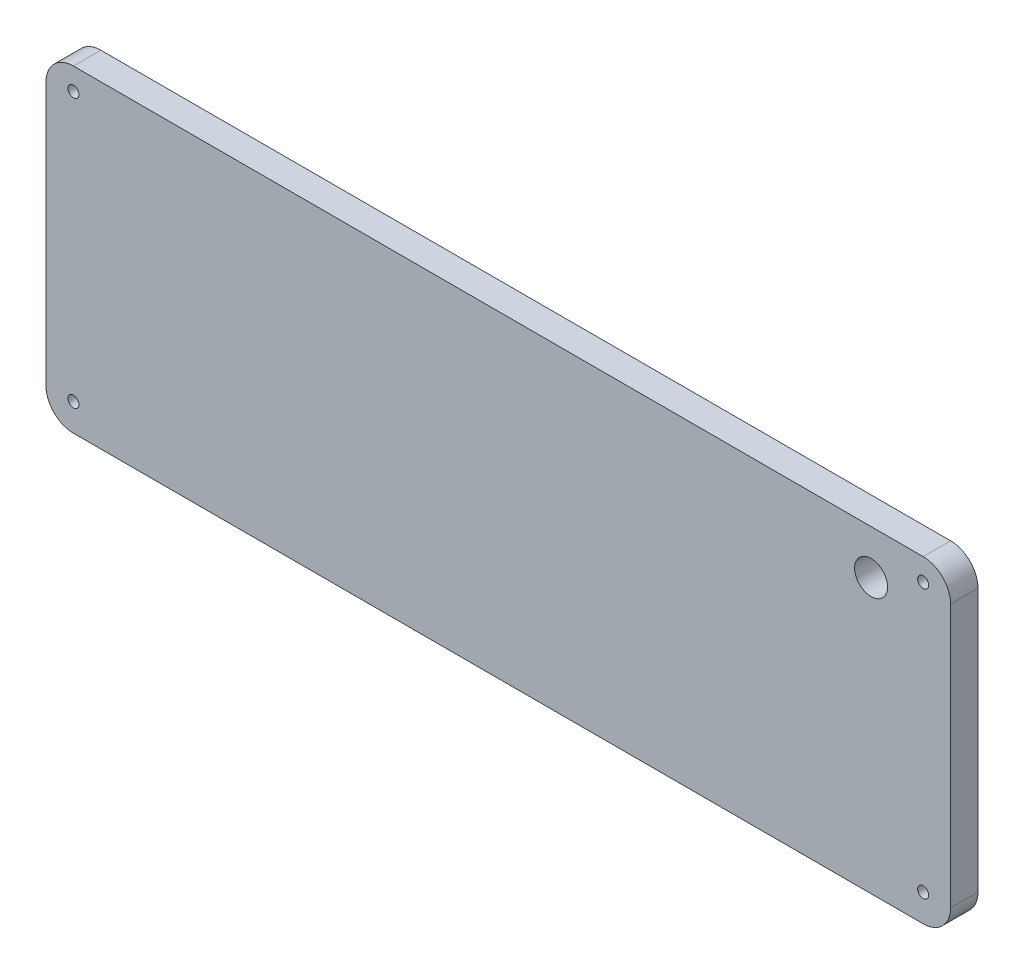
ISO-10303-21;
HEADER;
FILE_DESCRIPTION(('STEP AP214'),'2;1');
FILE_NAME('part.step','',(''),(''),'','','');
FILE_SCHEMA(('AUTOMOTIVE_DESIGN { 1 0 10303 214 1 1 1 1 }'));
ENDSEC;
DATA;
#1=APPLICATION_CONTEXT('core data for automotive mechanical design processes');
#2=APPLICATION_PROTOCOL_DEFINITION('international standard','automotive_design',2000,#1);
#3=PRODUCT_CONTEXT('',#1,'mechanical');
#4=PRODUCT('Part','Part','',(#3));
#5=PRODUCT_RELATED_PRODUCT_CATEGORY('part','',(#4));
#6=PRODUCT_DEFINITION_FORMATION('','',#4);
#7=PRODUCT_DEFINITION_CONTEXT('part definition',#1,'design');
#8=PRODUCT_DEFINITION('design','',#6,#7);
#9=PRODUCT_DEFINITION_SHAPE('','',#8);
#10=(LENGTH_UNIT() NAMED_UNIT(*) SI_UNIT(.MILLI.,.METRE.));
#11=(NAMED_UNIT(*) PLANE_ANGLE_UNIT() SI_UNIT($,.RADIAN.));
#12=(NAMED_UNIT(*) SI_UNIT($,.STERADIAN.) SOLID_ANGLE_UNIT());
#13=UNCERTAINTY_MEASURE_WITH_UNIT(LENGTH_MEASURE(1.E-05),#10,'distance_accuracy_value','');
#14=(GEOMETRIC_REPRESENTATION_CONTEXT(3) GLOBAL_UNCERTAINTY_ASSIGNED_CONTEXT((#13)) GLOBAL_UNIT_ASSIGNED_CONTEXT((#10,
#11,#12)) REPRESENTATION_CONTEXT('',''));
#15=CARTESIAN_POINT('',(0.,0.,0.));
#16=DIRECTION('',(0.,0.,1.));
#17=DIRECTION('',(1.,0.,0.));
#18=AXIS2_PLACEMENT_3D('',#15,#16,#17);
#19=CARTESIAN_POINT('',(90.5919495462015,-62.8912339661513,52.5871462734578));
#20=DIRECTION('',(-1.,0.,0.));
#21=DIRECTION('',(0.,0.,1.));
#22=AXIS2_PLACEMENT_3D('',#19,#20,#21);
#23=PLANE('',#22);
#24=DIRECTION('',(0.,1.,0.));
#25=VECTOR('',#24,1.);
#26=CARTESIAN_POINT('',(90.5919495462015,-62.8912339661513,42.5871462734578));
#27=LINE('',#26,#25);
#28=CARTESIAN_POINT('',(90.5919495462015,-52.8912339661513,42.5871462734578));
#29=VERTEX_POINT('',#28);
#30=CARTESIAN_POINT('',(90.5919495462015,43.1087660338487,42.5871462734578));
#31=VERTEX_POINT('',#30);
#32=EDGE_CURVE('E136',#29,#31,#27,.T.);
#33=ORIENTED_EDGE('',*,*,#32,.T.);
#34=DIRECTION('',(0.,0.,-1.));
#35=VECTOR('',#34,1.);
#36=CARTESIAN_POINT('',(90.5919495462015,43.1087660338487,52.5871462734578));
#37=LINE('',#36,#35);
#38=CARTESIAN_POINT('',(90.5919495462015,43.1087660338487,52.5871462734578));
#39=VERTEX_POINT('',#38);
#40=EDGE_CURVE('E111',#31,#39,#37,.F.);
#41=ORIENTED_EDGE('',*,*,#40,.T.);
#42=DIRECTION('',(0.,1.,0.));
#43=VECTOR('',#42,1.);
#44=CARTESIAN_POINT('',(90.5919495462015,-62.8912339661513,52.5871462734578));
#45=LINE('',#44,#43);
#46=CARTESIAN_POINT('',(90.5919495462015,-52.8912339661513,52.5871462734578));
#47=VERTEX_POINT('',#46);
#48=EDGE_CURVE('E149',#47,#39,#45,.T.);
#49=ORIENTED_EDGE('',*,*,#48,.F.);
#50=DIRECTION('',(0.,0.,-1.));
#51=VECTOR('',#50,1.);
#52=CARTESIAN_POINT('',(90.5919495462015,-52.8912339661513,52.5871462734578));
#53=LINE('',#52,#51);
#54=EDGE_CURVE('E117',#47,#29,#53,.T.);
#55=ORIENTED_EDGE('',*,*,#54,.T.);
#56=EDGE_LOOP('',(#33,#41,#49,#55));
#57=FACE_BOUND('',#56,.T.);
#58=ADVANCED_FACE('F39',(#57),#23,.F.);
#59=CARTESIAN_POINT('',(-239.408050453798,53.1087660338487,52.5871462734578));
#60=DIRECTION('',(0.,-1.,0.));
#61=DIRECTION('',(0.,0.,-1.));
#62=AXIS2_PLACEMENT_3D('',#59,#60,#61);
#63=PLANE('',#62);
#64=DIRECTION('',(-1.,0.,0.));
#65=VECTOR('',#64,1.);
#66=CARTESIAN_POINT('',(-239.408050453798,53.1087660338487,52.5871462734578));
#67=LINE('',#66,#65);
#68=CARTESIAN_POINT('',(80.5919495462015,53.1087660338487,52.5871462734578));
#69=VERTEX_POINT('',#68);
#70=CARTESIAN_POINT('',(-229.408050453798,53.1087660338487,52.5871462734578));
#71=VERTEX_POINT('',#70);
#72=EDGE_CURVE('E127',#69,#71,#67,.T.);
#73=ORIENTED_EDGE('',*,*,#72,.F.);
#74=DIRECTION('',(0.,0.,-1.));
#75=VECTOR('',#74,1.);
#76=CARTESIAN_POINT('',(80.5919495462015,53.1087660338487,52.5871462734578));
#77=LINE('',#76,#75);
#78=CARTESIAN_POINT('',(80.5919495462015,53.1087660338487,42.5871462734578));
#79=VERTEX_POINT('',#78);
#80=EDGE_CURVE('E110',#69,#79,#77,.T.);
#81=ORIENTED_EDGE('',*,*,#80,.T.);
#82=DIRECTION('',(-1.,0.,0.));
#83=VECTOR('',#82,1.);
#84=CARTESIAN_POINT('',(-239.408050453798,53.1087660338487,42.5871462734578));
#85=LINE('',#84,#83);
#86=CARTESIAN_POINT('',(-229.408050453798,53.1087660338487,42.5871462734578));
#87=VERTEX_POINT('',#86);
#88=EDGE_CURVE('E124',#79,#87,#85,.T.);
#89=ORIENTED_EDGE('',*,*,#88,.T.);
#90=DIRECTION('',(0.,0.,-1.));
#91=VECTOR('',#90,1.);
#92=CARTESIAN_POINT('',(-229.408050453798,53.1087660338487,52.5871462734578));
#93=LINE('',#92,#91);
#94=EDGE_CURVE('E130',#87,#71,#93,.F.);
#95=ORIENTED_EDGE('',*,*,#94,.T.);
#96=EDGE_LOOP('',(#73,#81,#89,#95));
#97=FACE_BOUND('',#96,.T.);
#98=ADVANCED_FACE('F123',(#97),#63,.F.);
#99=CARTESIAN_POINT('',(-239.408050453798,-62.8912339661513,52.5871462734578));
#100=DIRECTION('',(1.,0.,0.));
#101=DIRECTION('',(0.,0.,-1.));
#102=AXIS2_PLACEMENT_3D('',#99,#100,#101);
#103=PLANE('',#102);
#104=DIRECTION('',(0.,-1.,0.));
#105=VECTOR('',#104,1.);
#106=CARTESIAN_POINT('',(-239.408050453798,-62.8912339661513,42.5871462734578));
#107=LINE('',#106,#105);
#108=CARTESIAN_POINT('',(-239.408050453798,43.1087660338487,42.5871462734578));
#109=VERTEX_POINT('',#108);
#110=CARTESIAN_POINT('',(-239.408050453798,-52.8912339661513,42.5871462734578));
#111=VERTEX_POINT('',#110);
#112=EDGE_CURVE('E135',#109,#111,#107,.T.);
#113=ORIENTED_EDGE('',*,*,#112,.T.);
#114=DIRECTION('',(0.,0.,-1.));
#115=VECTOR('',#114,1.);
#116=CARTESIAN_POINT('',(-239.408050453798,-52.8912339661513,52.5871462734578));
#117=LINE('',#116,#115);
#118=CARTESIAN_POINT('',(-239.408050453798,-52.8912339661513,52.5871462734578));
#119=VERTEX_POINT('',#118);
#120=EDGE_CURVE('E11',#111,#119,#117,.F.);
#121=ORIENTED_EDGE('',*,*,#120,.T.);
#122=DIRECTION('',(0.,-1.,0.));
#123=VECTOR('',#122,1.);
#124=CARTESIAN_POINT('',(-239.408050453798,-62.8912339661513,52.5871462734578));
#125=LINE('',#124,#123);
#126=CARTESIAN_POINT('',(-239.408050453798,43.1087660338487,52.5871462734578));
#127=VERTEX_POINT('',#126);
#128=EDGE_CURVE('E188',#127,#119,#125,.T.);
#129=ORIENTED_EDGE('',*,*,#128,.F.);
#130=DIRECTION('',(0.,0.,-1.));
#131=VECTOR('',#130,1.);
#132=CARTESIAN_POINT('',(-239.408050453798,43.1087660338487,52.5871462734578));
#133=LINE('',#132,#131);
#134=EDGE_CURVE('E48',#127,#109,#133,.T.);
#135=ORIENTED_EDGE('',*,*,#134,.T.);
#136=EDGE_LOOP('',(#113,#121,#129,#135));
#137=FACE_BOUND('',#136,.T.);
#138=ADVANCED_FACE('F186',(#137),#103,.F.);
#139=CARTESIAN_POINT('',(-239.408050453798,-62.8912339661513,52.5871462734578));
#140=DIRECTION('',(0.,1.,0.));
#141=DIRECTION('',(0.,0.,1.));
#142=AXIS2_PLACEMENT_3D('',#139,#140,#141);
#143=PLANE('',#142);
#144=DIRECTION('',(1.,0.,0.));
#145=VECTOR('',#144,1.);
#146=CARTESIAN_POINT('',(-239.408050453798,-62.8912339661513,42.5871462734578));
#147=LINE('',#146,#145);
#148=CARTESIAN_POINT('',(-229.408050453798,-62.8912339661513,42.5871462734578));
#149=VERTEX_POINT('',#148);
#150=CARTESIAN_POINT('',(80.5919495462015,-62.8912339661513,42.5871462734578));
#151=VERTEX_POINT('',#150);
#152=EDGE_CURVE('E141',#149,#151,#147,.T.);
#153=ORIENTED_EDGE('',*,*,#152,.T.);
#154=DIRECTION('',(0.,0.,-1.));
#155=VECTOR('',#154,1.);
#156=CARTESIAN_POINT('',(80.5919495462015,-62.8912339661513,52.5871462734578));
#157=LINE('',#156,#155);
#158=CARTESIAN_POINT('',(80.5919495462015,-62.8912339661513,52.5871462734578));
#159=VERTEX_POINT('',#158);
#160=EDGE_CURVE('E55',#151,#159,#157,.F.);
#161=ORIENTED_EDGE('',*,*,#160,.T.);
#162=DIRECTION('',(1.,0.,0.));
#163=VECTOR('',#162,1.);
#164=CARTESIAN_POINT('',(-239.408050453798,-62.8912339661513,52.5871462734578));
#165=LINE('',#164,#163);
#166=CARTESIAN_POINT('',(-229.408050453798,-62.8912339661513,52.5871462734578));
#167=VERTEX_POINT('',#166);
#168=EDGE_CURVE('E151',#167,#159,#165,.T.);
#169=ORIENTED_EDGE('',*,*,#168,.F.);
#170=DIRECTION('',(0.,0.,-1.));
#171=VECTOR('',#170,1.);
#172=CARTESIAN_POINT('',(-229.408050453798,-62.8912339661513,52.5871462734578));
#173=LINE('',#172,#171);
#174=EDGE_CURVE('E176',#167,#149,#173,.T.);
#175=ORIENTED_EDGE('',*,*,#174,.T.);
#176=EDGE_LOOP('',(#153,#161,#169,#175));
#177=FACE_BOUND('',#176,.T.);
#178=ADVANCED_FACE('F195',(#177),#143,.F.);
#179=CARTESIAN_POINT('',(-74.4080504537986,-4.89123396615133,52.5871462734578));
#180=DIRECTION('',(0.,0.,-1.));
#181=DIRECTION('',(-1.,0.,0.));
#182=AXIS2_PLACEMENT_3D('',#179,#180,#181);
#183=PLANE('',#182);
#184=CARTESIAN_POINT('',(61.5919495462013,37.0087660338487,52.5871462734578));
#185=DIRECTION('',(0.,0.,-1.));
#186=DIRECTION('',(-1.,0.,0.));
#187=AXIS2_PLACEMENT_3D('',#184,#185,#186);
#188=CIRCLE('',#187,6.01426434);
#189=CARTESIAN_POINT('',(55.5776852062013,37.0087660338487,52.5871462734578));
#190=VERTEX_POINT('',#189);
#191=EDGE_CURVE('E234',#190,#190,#188,.T.);
#192=ORIENTED_EDGE('',*,*,#191,.T.);
#193=EDGE_LOOP('',(#192));
#194=FACE_BOUND('',#193,.T.);
#195=CARTESIAN_POINT('',(-229.408050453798,45.0587660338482,52.5871462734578));
#196=DIRECTION('',(0.,0.,1.));
#197=DIRECTION('',(1.,0.,0.));
#198=AXIS2_PLACEMENT_3D('',#195,#196,#197);
#199=CIRCLE('',#198,2.00102409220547);
#200=CARTESIAN_POINT('',(-227.407026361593,45.0587660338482,52.5871462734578));
#201=VERTEX_POINT('',#200);
#202=EDGE_CURVE('E223',#201,#201,#199,.T.);
#203=ORIENTED_EDGE('',*,*,#202,.F.);
#204=EDGE_LOOP('',(#203));
#205=FACE_BOUND('',#204,.T.);
#206=CARTESIAN_POINT('',(80.5919495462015,-52.8912339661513,52.5871462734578));
#207=DIRECTION('',(0.,0.,1.));
#208=DIRECTION('',(1.,0.,0.));
#209=AXIS2_PLACEMENT_3D('',#206,#207,#208);
#210=CIRCLE('',#209,2.);
#211=CARTESIAN_POINT('',(82.5919495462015,-52.8912339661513,52.5871462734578));
#212=VERTEX_POINT('',#211);
#213=EDGE_CURVE('E214',#212,#212,#210,.T.);
#214=ORIENTED_EDGE('',*,*,#213,.F.);
#215=EDGE_LOOP('',(#214));
#216=FACE_BOUND('',#215,.T.);
#217=CARTESIAN_POINT('',(80.5919495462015,45.0587660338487,52.5871462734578));
#218=DIRECTION('',(0.,0.,1.));
#219=DIRECTION('',(1.,0.,0.));
#220=AXIS2_PLACEMENT_3D('',#217,#218,#219);
#221=CIRCLE('',#220,2.);
#222=CARTESIAN_POINT('',(82.5919495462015,45.0587660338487,52.5871462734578));
#223=VERTEX_POINT('',#222);
#224=EDGE_CURVE('E230',#223,#223,#221,.T.);
#225=ORIENTED_EDGE('',*,*,#224,.F.);
#226=EDGE_LOOP('',(#225));
#227=FACE_BOUND('',#226,.T.);
#228=CARTESIAN_POINT('',(-229.408050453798,-52.8912339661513,52.5871462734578));
#229=DIRECTION('',(0.,0.,1.));
#230=DIRECTION('',(1.,0.,0.));
#231=AXIS2_PLACEMENT_3D('',#228,#229,#230);
#232=CIRCLE('',#231,2.);
#233=CARTESIAN_POINT('',(-227.408050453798,-52.8912339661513,52.5871462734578));
#234=VERTEX_POINT('',#233);
#235=EDGE_CURVE('E206',#234,#234,#232,.T.);
#236=ORIENTED_EDGE('',*,*,#235,.F.);
#237=EDGE_LOOP('',(#236));
#238=FACE_BOUND('',#237,.T.);
#239=ORIENTED_EDGE('',*,*,#48,.T.);
#240=CARTESIAN_POINT('',(80.5919495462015,43.1087660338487,52.5871462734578));
#241=DIRECTION('',(0.,0.,-1.));
#242=DIRECTION('',(-1.,0.,0.));
#243=AXIS2_PLACEMENT_3D('',#240,#241,#242);
#244=CIRCLE('',#243,10.);
#245=EDGE_CURVE('E173',#39,#69,#244,.F.);
#246=ORIENTED_EDGE('',*,*,#245,.T.);
#247=ORIENTED_EDGE('',*,*,#72,.T.);
#248=CARTESIAN_POINT('',(-229.408050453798,43.1087660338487,52.5871462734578));
#249=DIRECTION('',(0.,0.,-1.));
#250=DIRECTION('',(-1.,0.,0.));
#251=AXIS2_PLACEMENT_3D('',#248,#249,#250);
#252=CIRCLE('',#251,10.);
#253=EDGE_CURVE('E165',#71,#127,#252,.F.);
#254=ORIENTED_EDGE('',*,*,#253,.T.);
#255=ORIENTED_EDGE('',*,*,#128,.T.);
#256=CARTESIAN_POINT('',(-229.408050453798,-52.8912339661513,52.5871462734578));
#257=DIRECTION('',(0.,0.,-1.));
#258=DIRECTION('',(-1.,0.,0.));
#259=AXIS2_PLACEMENT_3D('',#256,#257,#258);
#260=CIRCLE('',#259,10.);
#261=EDGE_CURVE('E62',#119,#167,#260,.F.);
#262=ORIENTED_EDGE('',*,*,#261,.T.);
#263=ORIENTED_EDGE('',*,*,#168,.T.);
#264=CARTESIAN_POINT('',(80.5919495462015,-52.8912339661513,52.5871462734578));
#265=DIRECTION('',(0.,0.,-1.));
#266=DIRECTION('',(-1.,0.,0.));
#267=AXIS2_PLACEMENT_3D('',#264,#265,#266);
#268=CIRCLE('',#267,10.);
#269=EDGE_CURVE('E170',#159,#47,#268,.F.);
#270=ORIENTED_EDGE('',*,*,#269,.T.);
#271=EDGE_LOOP('',(#239,#246,#247,#254,#255,#262,#263,#270));
#272=FACE_BOUND('',#271,.T.);
#273=ADVANCED_FACE('F246',(#194,#205,#216,#227,#238,#272),#183,.F.);
#274=CARTESIAN_POINT('',(-74.4080504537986,-4.89123396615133,42.5871462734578));
#275=DIRECTION('',(0.,0.,-1.));
#276=DIRECTION('',(-1.,0.,0.));
#277=AXIS2_PLACEMENT_3D('',#274,#275,#276);
#278=PLANE('',#277);
#279=CARTESIAN_POINT('',(61.5919495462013,37.0087660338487,42.5871462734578));
#280=DIRECTION('',(0.,0.,-1.));
#281=DIRECTION('',(-1.,0.,0.));
#282=AXIS2_PLACEMENT_3D('',#279,#280,#281);
#283=CIRCLE('',#282,6.01426434);
#284=CARTESIAN_POINT('',(55.5776852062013,37.0087660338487,42.5871462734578));
#285=VERTEX_POINT('',#284);
#286=EDGE_CURVE('E238',#285,#285,#283,.T.);
#287=ORIENTED_EDGE('',*,*,#286,.F.);
#288=EDGE_LOOP('',(#287));
#289=FACE_BOUND('',#288,.T.);
#290=CARTESIAN_POINT('',(-229.408050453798,45.0587660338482,42.5871462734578));
#291=DIRECTION('',(0.,0.,1.));
#292=DIRECTION('',(1.,0.,0.));
#293=AXIS2_PLACEMENT_3D('',#290,#291,#292);
#294=CIRCLE('',#293,2.00102409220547);
#295=CARTESIAN_POINT('',(-227.407026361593,45.0587660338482,42.5871462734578));
#296=VERTEX_POINT('',#295);
#297=EDGE_CURVE('E210',#296,#296,#294,.T.);
#298=ORIENTED_EDGE('',*,*,#297,.T.);
#299=EDGE_LOOP('',(#298));
#300=FACE_BOUND('',#299,.T.);
#301=CARTESIAN_POINT('',(80.5919495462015,-52.8912339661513,42.5871462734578));
#302=DIRECTION('',(0.,0.,1.));
#303=DIRECTION('',(1.,0.,0.));
#304=AXIS2_PLACEMENT_3D('',#301,#302,#303);
#305=CIRCLE('',#304,2.);
#306=CARTESIAN_POINT('',(82.5919495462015,-52.8912339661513,42.5871462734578));
#307=VERTEX_POINT('',#306);
#308=EDGE_CURVE('E218',#307,#307,#305,.T.);
#309=ORIENTED_EDGE('',*,*,#308,.T.);
#310=EDGE_LOOP('',(#309));
#311=FACE_BOUND('',#310,.T.);
#312=CARTESIAN_POINT('',(80.5919495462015,45.0587660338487,42.5871462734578));
#313=DIRECTION('',(0.,0.,1.));
#314=DIRECTION('',(1.,0.,0.));
#315=AXIS2_PLACEMENT_3D('',#312,#313,#314);
#316=CIRCLE('',#315,2.);
#317=CARTESIAN_POINT('',(82.5919495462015,45.0587660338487,42.5871462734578));
#318=VERTEX_POINT('',#317);
#319=EDGE_CURVE('E219',#318,#318,#316,.T.);
#320=ORIENTED_EDGE('',*,*,#319,.T.);
#321=EDGE_LOOP('',(#320));
#322=FACE_BOUND('',#321,.T.);
#323=CARTESIAN_POINT('',(-229.408050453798,-52.8912339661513,42.5871462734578));
#324=DIRECTION('',(0.,0.,1.));
#325=DIRECTION('',(1.,0.,0.));
#326=AXIS2_PLACEMENT_3D('',#323,#324,#325);
#327=CIRCLE('',#326,2.);
#328=CARTESIAN_POINT('',(-227.408050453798,-52.8912339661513,42.5871462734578));
#329=VERTEX_POINT('',#328);
#330=EDGE_CURVE('E143',#329,#329,#327,.T.);
#331=ORIENTED_EDGE('',*,*,#330,.T.);
#332=EDGE_LOOP('',(#331));
#333=FACE_BOUND('',#332,.T.);
#334=ORIENTED_EDGE('',*,*,#88,.F.);
#335=CARTESIAN_POINT('',(80.5919495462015,43.1087660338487,42.5871462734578));
#336=DIRECTION('',(0.,0.,-1.));
#337=DIRECTION('',(-1.,0.,0.));
#338=AXIS2_PLACEMENT_3D('',#335,#336,#337);
#339=CIRCLE('',#338,10.);
#340=EDGE_CURVE('E106',#79,#31,#339,.T.);
#341=ORIENTED_EDGE('',*,*,#340,.T.);
#342=ORIENTED_EDGE('',*,*,#32,.F.);
#343=CARTESIAN_POINT('',(80.5919495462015,-52.8912339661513,42.5871462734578));
#344=DIRECTION('',(0.,0.,-1.));
#345=DIRECTION('',(-1.,0.,0.));
#346=AXIS2_PLACEMENT_3D('',#343,#344,#345);
#347=CIRCLE('',#346,10.);
#348=EDGE_CURVE('E118',#29,#151,#347,.T.);
#349=ORIENTED_EDGE('',*,*,#348,.T.);
#350=ORIENTED_EDGE('',*,*,#152,.F.);
#351=CARTESIAN_POINT('',(-229.408050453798,-52.8912339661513,42.5871462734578));
#352=DIRECTION('',(0.,0.,-1.));
#353=DIRECTION('',(-1.,0.,0.));
#354=AXIS2_PLACEMENT_3D('',#351,#352,#353);
#355=CIRCLE('',#354,10.);
#356=EDGE_CURVE('E155',#149,#111,#355,.T.);
#357=ORIENTED_EDGE('',*,*,#356,.T.);
#358=ORIENTED_EDGE('',*,*,#112,.F.);
#359=CARTESIAN_POINT('',(-229.408050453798,43.1087660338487,42.5871462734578));
#360=DIRECTION('',(0.,0.,-1.));
#361=DIRECTION('',(-1.,0.,0.));
#362=AXIS2_PLACEMENT_3D('',#359,#360,#361);
#363=CIRCLE('',#362,10.);
#364=EDGE_CURVE('E129',#109,#87,#363,.T.);
#365=ORIENTED_EDGE('',*,*,#364,.T.);
#366=EDGE_LOOP('',(#334,#341,#342,#349,#350,#357,#358,#365));
#367=FACE_BOUND('',#366,.T.);
#368=ADVANCED_FACE('F132',(#289,#300,#311,#322,#333,#367),#278,.T.);
#369=CARTESIAN_POINT('',(80.5919495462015,43.1087660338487,52.5871462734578));
#370=DIRECTION('',(0.,0.,-1.));
#371=DIRECTION('',(-1.,0.,0.));
#372=AXIS2_PLACEMENT_3D('',#369,#370,#371);
#373=CYLINDRICAL_SURFACE('',#372,10.);
#374=ORIENTED_EDGE('',*,*,#245,.F.);
#375=ORIENTED_EDGE('',*,*,#40,.F.);
#376=ORIENTED_EDGE('',*,*,#340,.F.);
#377=ORIENTED_EDGE('',*,*,#80,.F.);
#378=EDGE_LOOP('',(#374,#375,#376,#377));
#379=FACE_BOUND('',#378,.T.);
#380=ADVANCED_FACE('F109',(#379),#373,.T.);
#381=CARTESIAN_POINT('',(80.5919495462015,-52.8912339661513,52.5871462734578));
#382=DIRECTION('',(0.,0.,-1.));
#383=DIRECTION('',(-1.,0.,0.));
#384=AXIS2_PLACEMENT_3D('',#381,#382,#383);
#385=CYLINDRICAL_SURFACE('',#384,10.);
#386=ORIENTED_EDGE('',*,*,#269,.F.);
#387=ORIENTED_EDGE('',*,*,#160,.F.);
#388=ORIENTED_EDGE('',*,*,#348,.F.);
#389=ORIENTED_EDGE('',*,*,#54,.F.);
#390=EDGE_LOOP('',(#386,#387,#388,#389));
#391=FACE_BOUND('',#390,.T.);
#392=ADVANCED_FACE('F280',(#391),#385,.T.);
#393=CARTESIAN_POINT('',(-229.408050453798,-52.8912339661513,52.5871462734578));
#394=DIRECTION('',(0.,0.,-1.));
#395=DIRECTION('',(-1.,0.,0.));
#396=AXIS2_PLACEMENT_3D('',#393,#394,#395);
#397=CYLINDRICAL_SURFACE('',#396,10.);
#398=ORIENTED_EDGE('',*,*,#261,.F.);
#399=ORIENTED_EDGE('',*,*,#120,.F.);
#400=ORIENTED_EDGE('',*,*,#356,.F.);
#401=ORIENTED_EDGE('',*,*,#174,.F.);
#402=EDGE_LOOP('',(#398,#399,#400,#401));
#403=FACE_BOUND('',#402,.T.);
#404=ADVANCED_FACE('F194',(#403),#397,.T.);
#405=CARTESIAN_POINT('',(-229.408050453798,43.1087660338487,52.5871462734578));
#406=DIRECTION('',(0.,0.,-1.));
#407=DIRECTION('',(-1.,0.,0.));
#408=AXIS2_PLACEMENT_3D('',#405,#406,#407);
#409=CYLINDRICAL_SURFACE('',#408,10.);
#410=ORIENTED_EDGE('',*,*,#253,.F.);
#411=ORIENTED_EDGE('',*,*,#94,.F.);
#412=ORIENTED_EDGE('',*,*,#364,.F.);
#413=ORIENTED_EDGE('',*,*,#134,.F.);
#414=EDGE_LOOP('',(#410,#411,#412,#413));
#415=FACE_BOUND('',#414,.T.);
#416=ADVANCED_FACE('F41',(#415),#409,.T.);
#417=CARTESIAN_POINT('',(-229.408050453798,-52.8912339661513,42.5871462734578));
#418=DIRECTION('',(0.,0.,1.));
#419=DIRECTION('',(1.,0.,0.));
#420=AXIS2_PLACEMENT_3D('',#417,#418,#419);
#421=CYLINDRICAL_SURFACE('',#420,2.);
#422=ORIENTED_EDGE('',*,*,#330,.F.);
#423=EDGE_LOOP('',(#422));
#424=FACE_BOUND('',#423,.T.);
#425=ORIENTED_EDGE('',*,*,#235,.T.);
#426=EDGE_LOOP('',(#425));
#427=FACE_BOUND('',#426,.T.);
#428=ADVANCED_FACE('F267',(#424,#427),#421,.F.);
#429=CARTESIAN_POINT('',(80.5919495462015,45.0587660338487,42.5871462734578));
#430=DIRECTION('',(0.,0.,1.));
#431=DIRECTION('',(1.,0.,0.));
#432=AXIS2_PLACEMENT_3D('',#429,#430,#431);
#433=CYLINDRICAL_SURFACE('',#432,2.);
#434=ORIENTED_EDGE('',*,*,#319,.F.);
#435=EDGE_LOOP('',(#434));
#436=FACE_BOUND('',#435,.T.);
#437=ORIENTED_EDGE('',*,*,#224,.T.);
#438=EDGE_LOOP('',(#437));
#439=FACE_BOUND('',#438,.T.);
#440=ADVANCED_FACE('F270',(#436,#439),#433,.F.);
#441=CARTESIAN_POINT('',(80.5919495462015,-52.8912339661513,42.5871462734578));
#442=DIRECTION('',(0.,0.,1.));
#443=DIRECTION('',(1.,0.,0.));
#444=AXIS2_PLACEMENT_3D('',#441,#442,#443);
#445=CYLINDRICAL_SURFACE('',#444,2.);
#446=ORIENTED_EDGE('',*,*,#308,.F.);
#447=EDGE_LOOP('',(#446));
#448=FACE_BOUND('',#447,.T.);
#449=ORIENTED_EDGE('',*,*,#213,.T.);
#450=EDGE_LOOP('',(#449));
#451=FACE_BOUND('',#450,.T.);
#452=ADVANCED_FACE('F299',(#448,#451),#445,.F.);
#453=CARTESIAN_POINT('',(-229.408050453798,45.0587660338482,42.5871462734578));
#454=DIRECTION('',(0.,0.,1.));
#455=DIRECTION('',(1.,0.,0.));
#456=AXIS2_PLACEMENT_3D('',#453,#454,#455);
#457=CYLINDRICAL_SURFACE('',#456,2.00102409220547);
#458=ORIENTED_EDGE('',*,*,#297,.F.);
#459=EDGE_LOOP('',(#458));
#460=FACE_BOUND('',#459,.T.);
#461=ORIENTED_EDGE('',*,*,#202,.T.);
#462=EDGE_LOOP('',(#461));
#463=FACE_BOUND('',#462,.T.);
#464=ADVANCED_FACE('F252',(#460,#463),#457,.F.);
#465=CARTESIAN_POINT('',(61.5919495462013,37.0087660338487,52.5871462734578));
#466=DIRECTION('',(0.,0.,-1.));
#467=DIRECTION('',(-1.,0.,0.));
#468=AXIS2_PLACEMENT_3D('',#465,#466,#467);
#469=CYLINDRICAL_SURFACE('',#468,6.01426434);
#470=ORIENTED_EDGE('',*,*,#191,.F.);
#471=EDGE_LOOP('',(#470));
#472=FACE_BOUND('',#471,.T.);
#473=ORIENTED_EDGE('',*,*,#286,.T.);
#474=EDGE_LOOP('',(#473));
#475=FACE_BOUND('',#474,.T.);
#476=ADVANCED_FACE('F249',(#472,#475),#469,.F.);
#477=CLOSED_SHELL('',(#58,#98,#138,#178,#273,#368,#380,#392,#404,#416,#428,#440,#452,#464,#476));
#478=MANIFOLD_SOLID_BREP('B2',#477);
#479=ADVANCED_BREP_SHAPE_REPRESENTATION('',(#18,#478),#14);
#480=SHAPE_DEFINITION_REPRESENTATION(#9,#479);
ENDSEC;
END-ISO-10303-21;
